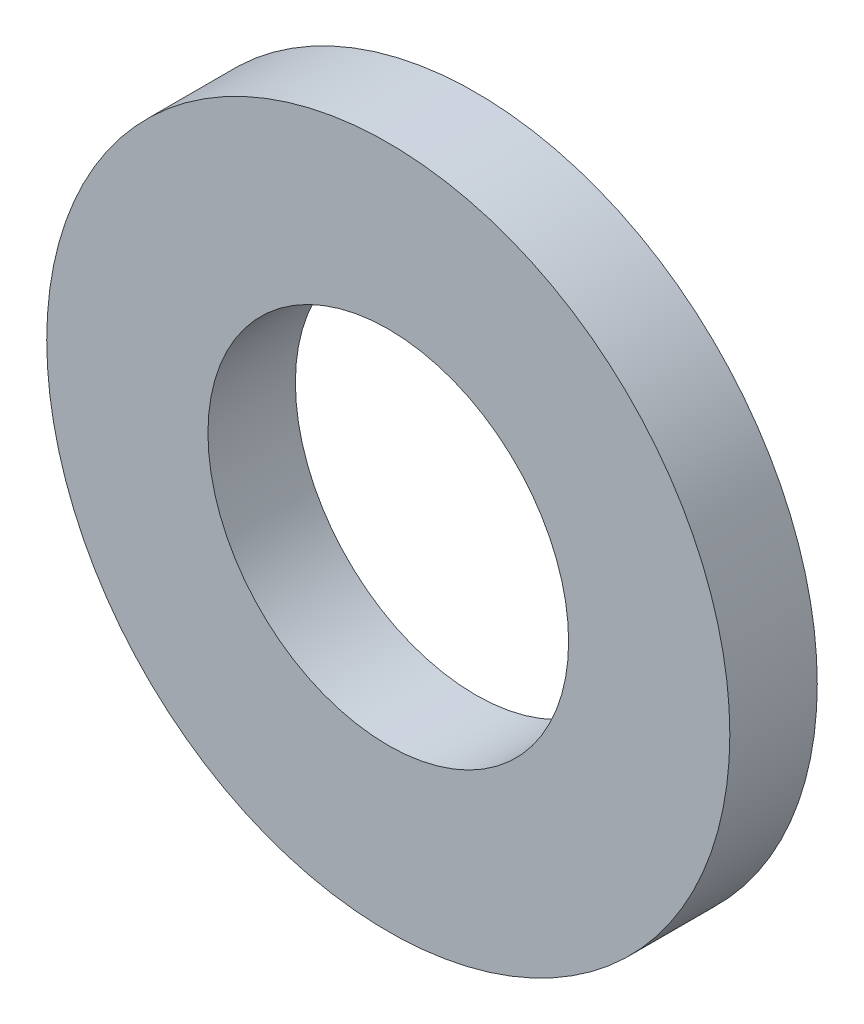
from build123d import *

# Parameters (mm, degrees)
BODYSKE_W = 2.95
BODYSKE_H = 1.6


with BuildPart() as part:
    # BodySke → BaseBody (revolve)
    with BuildSketch(Plane(origin=(0, 0, 0), x_dir=(1, 0, 0), z_dir=(0, 1, 0))):
        with Locations((4.775, 0.8)):
            Rectangle(BODYSKE_W, BODYSKE_H)
    revolve(axis=Axis((0, 0, 0), (0, 0, -1)))


solid = part.part
